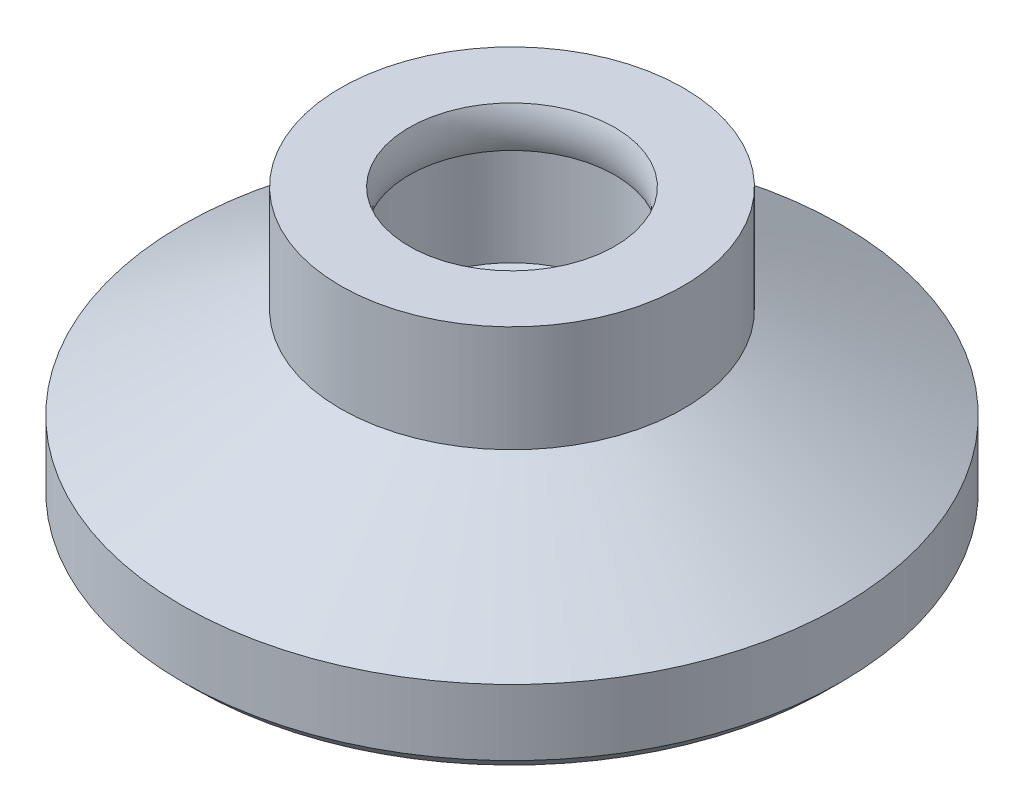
ISO-10303-21;
HEADER;
FILE_DESCRIPTION(('STEP AP214'),'2;1');
FILE_NAME('part.step','',(''),(''),'','','');
FILE_SCHEMA(('AUTOMOTIVE_DESIGN { 1 0 10303 214 1 1 1 1 }'));
ENDSEC;
DATA;
#1=APPLICATION_CONTEXT('core data for automotive mechanical design processes');
#2=APPLICATION_PROTOCOL_DEFINITION('international standard','automotive_design',2000,#1);
#3=PRODUCT_CONTEXT('',#1,'mechanical');
#4=PRODUCT('Part','Part','',(#3));
#5=PRODUCT_RELATED_PRODUCT_CATEGORY('part','',(#4));
#6=PRODUCT_DEFINITION_FORMATION('','',#4);
#7=PRODUCT_DEFINITION_CONTEXT('part definition',#1,'design');
#8=PRODUCT_DEFINITION('design','',#6,#7);
#9=PRODUCT_DEFINITION_SHAPE('','',#8);
#10=(LENGTH_UNIT() NAMED_UNIT(*) SI_UNIT(.MILLI.,.METRE.));
#11=(NAMED_UNIT(*) PLANE_ANGLE_UNIT() SI_UNIT($,.RADIAN.));
#12=(NAMED_UNIT(*) SI_UNIT($,.STERADIAN.) SOLID_ANGLE_UNIT());
#13=UNCERTAINTY_MEASURE_WITH_UNIT(LENGTH_MEASURE(1.E-05),#10,'distance_accuracy_value','');
#14=(GEOMETRIC_REPRESENTATION_CONTEXT(3) GLOBAL_UNCERTAINTY_ASSIGNED_CONTEXT((#13)) GLOBAL_UNIT_ASSIGNED_CONTEXT((#10,
#11,#12)) REPRESENTATION_CONTEXT('',''));
#15=CARTESIAN_POINT('',(0.,0.,0.));
#16=DIRECTION('',(0.,0.,1.));
#17=DIRECTION('',(1.,0.,0.));
#18=AXIS2_PLACEMENT_3D('',#15,#16,#17);
#19=CARTESIAN_POINT('',(0.,5.25,0.));
#20=DIRECTION('',(0.,-1.,0.));
#21=DIRECTION('',(0.,0.,-1.));
#22=AXIS2_PLACEMENT_3D('',#19,#20,#21);
#23=CYLINDRICAL_SURFACE('',#22,6.5);
#24=CARTESIAN_POINT('',(0.,1.21410161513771,0.));
#25=DIRECTION('',(0.,1.,0.));
#26=DIRECTION('',(0.,0.,1.));
#27=AXIS2_PLACEMENT_3D('',#24,#25,#26);
#28=CIRCLE('',#27,6.5);
#29=CARTESIAN_POINT('',(0.,1.21410161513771,-6.5));
#30=VERTEX_POINT('',#29);
#31=EDGE_CURVE('E90',#30,#30,#28,.T.);
#32=CARTESIAN_POINT('',(0.,5.25,0.));
#33=DIRECTION('',(0.,1.,0.));
#34=DIRECTION('',(0.,0.,1.));
#35=AXIS2_PLACEMENT_3D('',#32,#33,#34);
#36=CIRCLE('',#35,6.5);
#37=CARTESIAN_POINT('',(0.,5.25,-6.5));
#38=VERTEX_POINT('',#37);
#39=EDGE_CURVE('E92',#38,#38,#36,.T.);
#40=CARTESIAN_POINT('',(0.,1.21410161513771,-6.5));
#41=CARTESIAN_POINT('',(0.,1.25614222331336,-6.5));
#42=CARTESIAN_POINT('',(0.,1.29818283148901,-6.5));
#43=CARTESIAN_POINT('',(0.,1.3822640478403,-6.5));
#44=CARTESIAN_POINT('',(0.,1.42430465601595,-6.5));
#45=CARTESIAN_POINT('',(0.,1.50838587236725,-6.5));
#46=CARTESIAN_POINT('',(0.,1.5504264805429,-6.5));
#47=CARTESIAN_POINT('',(0.,1.6345076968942,-6.5));
#48=CARTESIAN_POINT('',(0.,1.67654830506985,-6.5));
#49=CARTESIAN_POINT('',(0.,1.76062952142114,-6.5));
#50=CARTESIAN_POINT('',(0.,1.80267012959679,-6.5));
#51=CARTESIAN_POINT('',(0.,1.88675134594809,-6.5));
#52=CARTESIAN_POINT('',(0.,1.92879195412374,-6.5));
#53=CARTESIAN_POINT('',(0.,2.01287317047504,-6.5));
#54=CARTESIAN_POINT('',(0.,2.05491377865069,-6.5));
#55=CARTESIAN_POINT('',(0.,2.13899499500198,-6.5));
#56=CARTESIAN_POINT('',(0.,2.18103560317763,-6.5));
#57=CARTESIAN_POINT('',(0.,2.26511681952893,-6.5));
#58=CARTESIAN_POINT('',(0.,2.30715742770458,-6.5));
#59=CARTESIAN_POINT('',(0.,2.39123864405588,-6.5));
#60=CARTESIAN_POINT('',(0.,2.43327925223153,-6.5));
#61=CARTESIAN_POINT('',(0.,2.51736046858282,-6.5));
#62=CARTESIAN_POINT('',(0.,2.55940107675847,-6.5));
#63=CARTESIAN_POINT('',(0.,2.64348229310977,-6.5));
#64=CARTESIAN_POINT('',(0.,2.68552290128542,-6.5));
#65=CARTESIAN_POINT('',(0.,2.76960411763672,-6.5));
#66=CARTESIAN_POINT('',(0.,2.81164472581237,-6.5));
#67=CARTESIAN_POINT('',(0.,2.89572594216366,-6.5));
#68=CARTESIAN_POINT('',(0.,2.93776655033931,-6.5));
#69=CARTESIAN_POINT('',(0.,3.02184776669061,-6.5));
#70=CARTESIAN_POINT('',(0.,3.06388837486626,-6.5));
#71=CARTESIAN_POINT('',(0.,3.14796959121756,-6.5));
#72=CARTESIAN_POINT('',(0.,3.19001019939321,-6.5));
#73=CARTESIAN_POINT('',(0.,3.2740914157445,-6.5));
#74=CARTESIAN_POINT('',(0.,3.31613202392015,-6.5));
#75=CARTESIAN_POINT('',(0.,3.40021324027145,-6.5));
#76=CARTESIAN_POINT('',(0.,3.4422538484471,-6.5));
#77=CARTESIAN_POINT('',(0.,3.5263350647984,-6.5));
#78=CARTESIAN_POINT('',(0.,3.56837567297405,-6.5));
#79=CARTESIAN_POINT('',(0.,3.65245688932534,-6.5));
#80=CARTESIAN_POINT('',(0.,3.69449749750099,-6.5));
#81=CARTESIAN_POINT('',(0.,3.77857871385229,-6.5));
#82=CARTESIAN_POINT('',(0.,3.82061932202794,-6.5));
#83=CARTESIAN_POINT('',(0.,3.90470053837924,-6.5));
#84=CARTESIAN_POINT('',(0.,3.94674114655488,-6.5));
#85=CARTESIAN_POINT('',(0.,4.03082236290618,-6.5));
#86=CARTESIAN_POINT('',(0.,4.07286297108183,-6.5));
#87=CARTESIAN_POINT('',(0.,4.15694418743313,-6.5));
#88=CARTESIAN_POINT('',(0.,4.19898479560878,-6.5));
#89=CARTESIAN_POINT('',(0.,4.28306601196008,-6.5));
#90=CARTESIAN_POINT('',(0.,4.32510662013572,-6.5));
#91=CARTESIAN_POINT('',(0.,4.40918783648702,-6.5));
#92=CARTESIAN_POINT('',(0.,4.45122844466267,-6.5));
#93=CARTESIAN_POINT('',(0.,4.53530966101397,-6.5));
#94=CARTESIAN_POINT('',(0.,4.57735026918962,-6.5));
#95=CARTESIAN_POINT('',(0.,4.66143148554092,-6.5));
#96=CARTESIAN_POINT('',(0.,4.70347209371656,-6.5));
#97=CARTESIAN_POINT('',(0.,4.78755331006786,-6.5));
#98=CARTESIAN_POINT('',(0.,4.82959391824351,-6.5));
#99=CARTESIAN_POINT('',(0.,4.91367513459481,-6.5));
#100=CARTESIAN_POINT('',(0.,4.95571574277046,-6.5));
#101=CARTESIAN_POINT('',(0.,5.03979695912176,-6.5));
#102=CARTESIAN_POINT('',(0.,5.0818375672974,-6.5));
#103=CARTESIAN_POINT('',(0.,5.1659187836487,-6.5));
#104=CARTESIAN_POINT('',(0.,5.20795939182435,-6.5));
#105=CARTESIAN_POINT('',(0.,5.25,-6.5));
#106=B_SPLINE_CURVE_WITH_KNOTS('',3,(#40,#41,#42,#43,#44,#45,#46,#47,#48,#49,#50,#51,#52,#53,
#54,#55,#56,#57,#58,#59,#60,#61,#62,#63,#64,#65,#66,#67,#68,#69,#70,#71,#72,#73,#74,#75,#76,#77,
#78,#79,#80,#81,#82,#83,#84,#85,#86,#87,#88,#89,#90,#91,#92,#93,#94,#95,#96,#97,#98,#99,#100,
#101,#102,#103,#104,#105),.UNSPECIFIED.,.F.,.F.,(4,2,2,2,2,2,2,2,2,2,2,2,2,2,2,2,2,2,2,2,2,2,2,
2,2,2,2,2,2,2,2,2,4),(0.,0.126121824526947,0.252243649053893,0.378365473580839,
0.504487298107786,0.630609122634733,0.756730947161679,0.882852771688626,1.00897459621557,
1.13509642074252,1.26121824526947,1.38734006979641,1.51346189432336,1.63958371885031,
1.76570554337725,1.8918273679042,2.01794919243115,2.14407101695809,2.27019284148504,
2.39631466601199,2.52243649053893,2.64855831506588,2.77468013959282,2.90080196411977,
3.02692378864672,3.15304561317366,3.27916743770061,3.40528926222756,3.5314110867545,
3.65753291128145,3.7836547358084,3.90977656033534,4.03589838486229),.UNSPECIFIED.);
#107=EDGE_CURVE('BSEAM36',#30,#38,#106,.T.);
#108=ORIENTED_EDGE('',*,*,#31,.T.);
#109=ORIENTED_EDGE('',*,*,#39,.F.);
#110=ORIENTED_EDGE('',*,*,#107,.T.);
#111=ORIENTED_EDGE('',*,*,#107,.F.);
#112=EDGE_LOOP('',(#108,#110,#109,#111));
#113=FACE_BOUND('',#112,.T.);
#114=ADVANCED_FACE('F36',(#113),#23,.T.);
#115=CARTESIAN_POINT('',(0.,5.25,0.));
#116=DIRECTION('',(0.,1.,0.));
#117=DIRECTION('',(0.,0.,1.));
#118=AXIS2_PLACEMENT_3D('',#115,#116,#117);
#119=PLANE('',#118);
#120=CARTESIAN_POINT('',(0.,5.25,0.));
#121=DIRECTION('',(0.,-1.,0.));
#122=DIRECTION('',(0.,0.,-1.));
#123=AXIS2_PLACEMENT_3D('',#120,#121,#122);
#124=CIRCLE('',#123,3.9);
#125=CARTESIAN_POINT('',(0.,5.25,-3.9));
#126=VERTEX_POINT('',#125);
#127=EDGE_CURVE('E112',#126,#126,#124,.T.);
#128=ORIENTED_EDGE('',*,*,#127,.T.);
#129=EDGE_LOOP('',(#128));
#130=FACE_BOUND('',#129,.T.);
#131=ORIENTED_EDGE('',*,*,#39,.T.);
#132=EDGE_LOOP('',(#131));
#133=FACE_BOUND('',#132,.T.);
#134=ADVANCED_FACE('F64',(#130,#133),#119,.T.);
#135=CARTESIAN_POINT('',(0.,1.21410161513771,0.));
#136=DIRECTION('',(0.,-1.,0.));
#137=DIRECTION('',(0.,0.,-1.));
#138=AXIS2_PLACEMENT_3D('',#135,#136,#137);
#139=CONICAL_SURFACE('',#138,6.5,1.0471975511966);
#140=CARTESIAN_POINT('',(0.,-2.25,0.));
#141=DIRECTION('',(0.,1.,0.));
#142=DIRECTION('',(0.,0.,1.));
#143=AXIS2_PLACEMENT_3D('',#140,#141,#142);
#144=CIRCLE('',#143,12.5);
#145=CARTESIAN_POINT('',(0.,-2.25,12.5));
#146=VERTEX_POINT('',#145);
#147=EDGE_CURVE('E88',#146,#146,#144,.T.);
#148=ORIENTED_EDGE('',*,*,#147,.T.);
#149=EDGE_LOOP('',(#148));
#150=FACE_BOUND('',#149,.T.);
#151=ORIENTED_EDGE('',*,*,#31,.F.);
#152=EDGE_LOOP('',(#151));
#153=FACE_BOUND('',#152,.T.);
#154=ADVANCED_FACE('F69',(#150,#153),#139,.T.);
#155=CARTESIAN_POINT('',(0.,-5.25,0.));
#156=DIRECTION('',(0.,1.,0.));
#157=DIRECTION('',(0.,0.,1.));
#158=AXIS2_PLACEMENT_3D('',#155,#156,#157);
#159=PLANE('',#158);
#160=CARTESIAN_POINT('',(0.,-5.25,0.));
#161=DIRECTION('',(0.,1.,0.));
#162=DIRECTION('',(0.,0.,1.));
#163=AXIS2_PLACEMENT_3D('',#160,#161,#162);
#164=CIRCLE('',#163,12.);
#165=CARTESIAN_POINT('',(0.,-5.25,12.));
#166=VERTEX_POINT('',#165);
#167=EDGE_CURVE('E44',#166,#166,#164,.F.);
#168=ORIENTED_EDGE('',*,*,#167,.T.);
#169=EDGE_LOOP('',(#168));
#170=FACE_BOUND('',#169,.T.);
#171=ADVANCED_FACE('F75',(#170),#159,.F.);
#172=CARTESIAN_POINT('',(0.,-2.25,0.));
#173=DIRECTION('',(0.,-1.,0.));
#174=DIRECTION('',(0.,0.,-1.));
#175=AXIS2_PLACEMENT_3D('',#172,#173,#174);
#176=CYLINDRICAL_SURFACE('',#175,12.5);
#177=CARTESIAN_POINT('',(0.,-4.75,0.));
#178=DIRECTION('',(0.,1.,0.));
#179=DIRECTION('',(0.,0.,1.));
#180=AXIS2_PLACEMENT_3D('',#177,#178,#179);
#181=CIRCLE('',#180,12.5);
#182=CARTESIAN_POINT('',(0.,-4.75,12.5));
#183=VERTEX_POINT('',#182);
#184=EDGE_CURVE('E11',#183,#183,#181,.T.);
#185=ORIENTED_EDGE('',*,*,#184,.T.);
#186=EDGE_LOOP('',(#185));
#187=FACE_BOUND('',#186,.T.);
#188=ORIENTED_EDGE('',*,*,#147,.F.);
#189=EDGE_LOOP('',(#188));
#190=FACE_BOUND('',#189,.T.);
#191=ADVANCED_FACE('F59',(#187,#190),#176,.T.);
#192=CARTESIAN_POINT('',(0.,-5.25,0.));
#193=DIRECTION('',(0.,1.,0.));
#194=DIRECTION('',(0.,0.,1.));
#195=AXIS2_PLACEMENT_3D('',#192,#193,#194);
#196=CONICAL_SURFACE('',#195,12.,0.785398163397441);
#197=ORIENTED_EDGE('',*,*,#184,.F.);
#198=EDGE_LOOP('',(#197));
#199=FACE_BOUND('',#198,.T.);
#200=ORIENTED_EDGE('',*,*,#167,.F.);
#201=EDGE_LOOP('',(#200));
#202=FACE_BOUND('',#201,.T.);
#203=ADVANCED_FACE('F38',(#199,#202),#196,.T.);
#204=CARTESIAN_POINT('',(0.,-2.25,0.));
#205=DIRECTION('',(0.,1.,0.));
#206=DIRECTION('',(0.,0.,1.));
#207=AXIS2_PLACEMENT_3D('',#204,#205,#206);
#208=CONICAL_SURFACE('',#207,0.,1.04719755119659);
#209=CARTESIAN_POINT('',(0.,0.00166604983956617,0.));
#210=DIRECTION('',(0.,-1.,0.));
#211=DIRECTION('',(0.,0.,-1.));
#212=AXIS2_PLACEMENT_3D('',#209,#210,#211);
#213=CIRCLE('',#212,3.9);
#214=CARTESIAN_POINT('',(0.,0.00166604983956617,-3.9));
#215=VERTEX_POINT('',#214);
#216=EDGE_CURVE('E100',#215,#215,#213,.T.);
#217=ORIENTED_EDGE('',*,*,#216,.F.);
#218=EDGE_LOOP('',(#217));
#219=FACE_BOUND('',#218,.T.);
#220=CARTESIAN_POINT('',(0.,-2.25,0.));
#221=VERTEX_POINT('',#220);
#222=VERTEX_LOOP('',#221);
#223=FACE_BOUND('',#222,.T.);
#224=ADVANCED_FACE('F47',(#219,#223),#208,.F.);
#225=CARTESIAN_POINT('',(0.,0.,0.));
#226=DIRECTION('',(0.,-1.,0.));
#227=DIRECTION('',(0.,0.,-1.));
#228=AXIS2_PLACEMENT_3D('',#225,#226,#227);
#229=CYLINDRICAL_SURFACE('',#228,3.9);
#230=CARTESIAN_POINT('',(0.,3.69,0.));
#231=DIRECTION('',(0.,-1.,0.));
#232=DIRECTION('',(0.,0.,-1.));
#233=AXIS2_PLACEMENT_3D('',#230,#231,#232);
#234=CIRCLE('',#233,3.9);
#235=CARTESIAN_POINT('',(0.,3.69,-3.9));
#236=VERTEX_POINT('',#235);
#237=EDGE_CURVE('E109',#236,#236,#234,.T.);
#238=ORIENTED_EDGE('',*,*,#237,.F.);
#239=EDGE_LOOP('',(#238));
#240=FACE_BOUND('',#239,.T.);
#241=ORIENTED_EDGE('',*,*,#216,.T.);
#242=EDGE_LOOP('',(#241));
#243=FACE_BOUND('',#242,.T.);
#244=ADVANCED_FACE('F49',(#240,#243),#229,.F.);
#245=CARTESIAN_POINT('',(0.,4.47,0.));
#246=DIRECTION('',(0.,-1.,0.));
#247=DIRECTION('',(0.,0.,-1.));
#248=AXIS2_PLACEMENT_3D('',#245,#246,#247);
#249=TOROIDAL_SURFACE('',#248,5.77199999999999,2.02799999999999);
#250=ORIENTED_EDGE('',*,*,#127,.F.);
#251=EDGE_LOOP('',(#250));
#252=FACE_BOUND('',#251,.T.);
#253=ORIENTED_EDGE('',*,*,#237,.T.);
#254=EDGE_LOOP('',(#253));
#255=FACE_BOUND('',#254,.T.);
#256=ADVANCED_FACE('F56',(#252,#255),#249,.T.);
#257=CLOSED_SHELL('',(#114,#134,#154,#171,#191,#203,#224,#244,#256));
#258=MANIFOLD_SOLID_BREP('B2',#257);
#259=ADVANCED_BREP_SHAPE_REPRESENTATION('',(#18,#258),#14);
#260=SHAPE_DEFINITION_REPRESENTATION(#9,#259);
ENDSEC;
END-ISO-10303-21;
